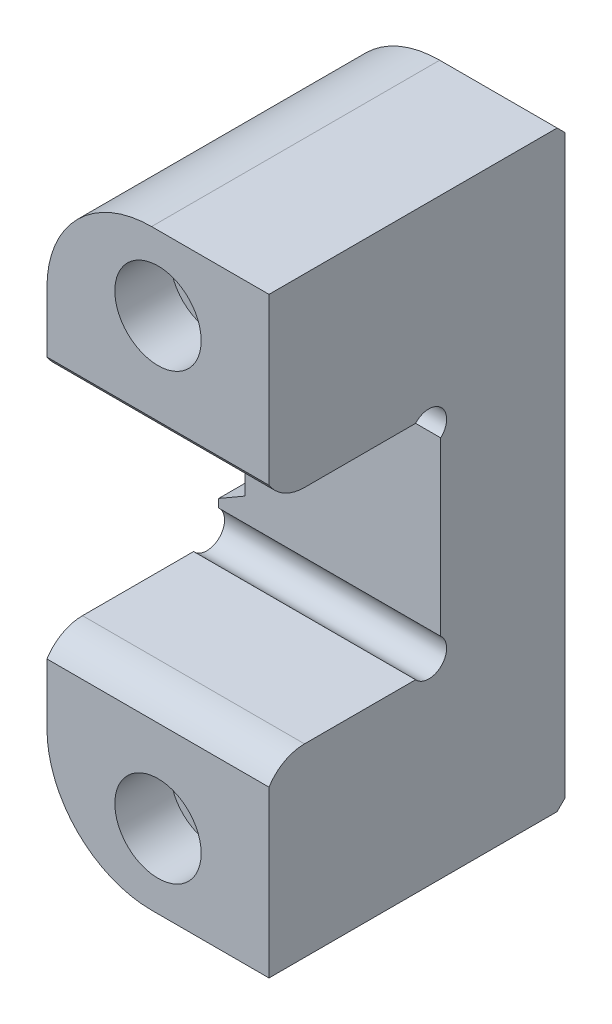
ISO-10303-21;
HEADER;
FILE_DESCRIPTION(('STEP AP214'),'2;1');
FILE_NAME('part.step','',(''),(''),'','','');
FILE_SCHEMA(('AUTOMOTIVE_DESIGN { 1 0 10303 214 1 1 1 1 }'));
ENDSEC;
DATA;
#1=APPLICATION_CONTEXT('core data for automotive mechanical design processes');
#2=APPLICATION_PROTOCOL_DEFINITION('international standard','automotive_design',2000,#1);
#3=PRODUCT_CONTEXT('',#1,'mechanical');
#4=PRODUCT('Part','Part','',(#3));
#5=PRODUCT_RELATED_PRODUCT_CATEGORY('part','',(#4));
#6=PRODUCT_DEFINITION_FORMATION('','',#4);
#7=PRODUCT_DEFINITION_CONTEXT('part definition',#1,'design');
#8=PRODUCT_DEFINITION('design','',#6,#7);
#9=PRODUCT_DEFINITION_SHAPE('','',#8);
#10=(LENGTH_UNIT() NAMED_UNIT(*) SI_UNIT(.MILLI.,.METRE.));
#11=(NAMED_UNIT(*) PLANE_ANGLE_UNIT() SI_UNIT($,.RADIAN.));
#12=(NAMED_UNIT(*) SI_UNIT($,.STERADIAN.) SOLID_ANGLE_UNIT());
#13=UNCERTAINTY_MEASURE_WITH_UNIT(LENGTH_MEASURE(1.E-05),#10,'distance_accuracy_value','');
#14=(GEOMETRIC_REPRESENTATION_CONTEXT(3) GLOBAL_UNCERTAINTY_ASSIGNED_CONTEXT((#13)) GLOBAL_UNIT_ASSIGNED_CONTEXT((#10,
#11,#12)) REPRESENTATION_CONTEXT('',''));
#15=CARTESIAN_POINT('',(0.,0.,0.));
#16=DIRECTION('',(0.,0.,1.));
#17=DIRECTION('',(1.,0.,0.));
#18=AXIS2_PLACEMENT_3D('',#15,#16,#17);
#19=CARTESIAN_POINT('',(14.2875,14.2875,-22.098));
#20=DIRECTION('',(0.,0.,-1.));
#21=DIRECTION('',(-1.,0.,0.));
#22=AXIS2_PLACEMENT_3D('',#19,#20,#21);
#23=PLANE('',#22);
#24=DIRECTION('',(-0.866025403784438,0.5,0.));
#25=VECTOR('',#24,1.);
#26=CARTESIAN_POINT('',(5.27996450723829,-1.31400912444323,-22.098));
#27=LINE('',#26,#25);
#28=CARTESIAN_POINT('',(-10.8853635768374,8.01904739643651,-22.098));
#29=VERTEX_POINT('',#28);
#30=CARTESIAN_POINT('',(-14.2875,9.98327177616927,-22.098));
#31=VERTEX_POINT('',#30);
#32=EDGE_CURVE('E340',#29,#31,#27,.T.);
#33=ORIENTED_EDGE('',*,*,#32,.F.);
#34=DIRECTION('',(0.,-1.,0.));
#35=VECTOR('',#34,1.);
#36=CARTESIAN_POINT('',(-10.8853635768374,-8.60845644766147,-22.098));
#37=LINE('',#36,#35);
#38=CARTESIAN_POINT('',(-10.8853635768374,-8.01904739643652,-22.098));
#39=VERTEX_POINT('',#38);
#40=EDGE_CURVE('E255',#29,#39,#37,.T.);
#41=ORIENTED_EDGE('',*,*,#40,.T.);
#42=DIRECTION('',(0.866025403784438,0.5,0.));
#43=VECTOR('',#42,1.);
#44=CARTESIAN_POINT('',(17.6533024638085,8.45775912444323,-22.098));
#45=LINE('',#44,#43);
#46=CARTESIAN_POINT('',(-14.2875,-9.98327177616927,-22.098));
#47=VERTEX_POINT('',#46);
#48=EDGE_CURVE('E338',#47,#39,#45,.T.);
#49=ORIENTED_EDGE('',*,*,#48,.F.);
#50=DIRECTION('',(0.,-1.,0.));
#51=VECTOR('',#50,1.);
#52=CARTESIAN_POINT('',(-14.2875,14.2875,-22.098));
#53=LINE('',#52,#51);
#54=CARTESIAN_POINT('',(-14.2875,-11.0596162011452,-22.098));
#55=VERTEX_POINT('',#54);
#56=EDGE_CURVE('E221',#47,#55,#53,.T.);
#57=ORIENTED_EDGE('',*,*,#56,.T.);
#58=DIRECTION('',(1.,0.,0.));
#59=VECTOR('',#58,1.);
#60=CARTESIAN_POINT('',(-14.2875,-11.0596162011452,-22.098));
#61=LINE('',#60,#59);
#62=CARTESIAN_POINT('',(14.2875,-11.0596162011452,-22.098));
#63=VERTEX_POINT('',#62);
#64=EDGE_CURVE('E194',#55,#63,#61,.T.);
#65=ORIENTED_EDGE('',*,*,#64,.T.);
#66=DIRECTION('',(0.,-1.,0.));
#67=VECTOR('',#66,1.);
#68=CARTESIAN_POINT('',(14.2875,14.2875,-22.098));
#69=LINE('',#68,#67);
#70=CARTESIAN_POINT('',(14.2875,11.0596162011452,-22.098));
#71=VERTEX_POINT('',#70);
#72=EDGE_CURVE('E348',#71,#63,#69,.T.);
#73=ORIENTED_EDGE('',*,*,#72,.F.);
#74=DIRECTION('',(1.,0.,0.));
#75=VECTOR('',#74,1.);
#76=CARTESIAN_POINT('',(-14.2875,11.0596162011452,-22.098));
#77=LINE('',#76,#75);
#78=CARTESIAN_POINT('',(-14.2875,11.0596162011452,-22.098));
#79=VERTEX_POINT('',#78);
#80=EDGE_CURVE('E416',#71,#79,#77,.F.);
#81=ORIENTED_EDGE('',*,*,#80,.T.);
#82=EDGE_CURVE('E215',#79,#31,#53,.T.);
#83=ORIENTED_EDGE('',*,*,#82,.T.);
#84=EDGE_LOOP('',(#33,#41,#49,#57,#65,#73,#81,#83));
#85=FACE_BOUND('',#84,.T.);
#86=ADVANCED_FACE('F32',(#85),#23,.F.);
#87=CARTESIAN_POINT('',(14.2875,38.1,-38.1));
#88=DIRECTION('',(0.,0.,1.));
#89=DIRECTION('',(1.,0.,0.));
#90=AXIS2_PLACEMENT_3D('',#87,#88,#89);
#91=PLANE('',#90);
#92=CARTESIAN_POINT('',(0.,28.575,-38.1));
#93=DIRECTION('',(0.,0.,1.));
#94=DIRECTION('',(1.,0.,0.));
#95=AXIS2_PLACEMENT_3D('',#92,#93,#94);
#96=CIRCLE('',#95,3.57123999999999);
#97=CARTESIAN_POINT('',(3.57123999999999,28.575,-38.1));
#98=VERTEX_POINT('',#97);
#99=EDGE_CURVE('E723',#98,#98,#96,.T.);
#100=ORIENTED_EDGE('',*,*,#99,.T.);
#101=EDGE_LOOP('',(#100));
#102=FACE_BOUND('',#101,.T.);
#103=CARTESIAN_POINT('',(0.,-28.575,-38.1));
#104=DIRECTION('',(0.,0.,1.));
#105=DIRECTION('',(1.,0.,0.));
#106=AXIS2_PLACEMENT_3D('',#103,#104,#105);
#107=CIRCLE('',#106,3.57123999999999);
#108=CARTESIAN_POINT('',(3.57123999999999,-28.575,-38.1));
#109=VERTEX_POINT('',#108);
#110=EDGE_CURVE('E709',#109,#109,#107,.T.);
#111=ORIENTED_EDGE('',*,*,#110,.T.);
#112=EDGE_LOOP('',(#111));
#113=FACE_BOUND('',#112,.T.);
#114=CARTESIAN_POINT('',(-0.8255,-24.638,-38.1));
#115=DIRECTION('',(0.,0.,1.));
#116=DIRECTION('',(1.,0.,0.));
#117=AXIS2_PLACEMENT_3D('',#114,#115,#116);
#118=CIRCLE('',#117,12.446);
#119=CARTESIAN_POINT('',(-0.8255,-37.084,-38.1));
#120=VERTEX_POINT('',#119);
#121=CARTESIAN_POINT('',(-13.2715,-24.638,-38.1));
#122=VERTEX_POINT('',#121);
#123=EDGE_CURVE('E271',#120,#122,#118,.F.);
#124=ORIENTED_EDGE('',*,*,#123,.T.);
#125=DIRECTION('',(0.,1.,0.));
#126=VECTOR('',#125,1.);
#127=CARTESIAN_POINT('',(-13.2715,-9.98327177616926,-38.1));
#128=LINE('',#127,#126);
#129=CARTESIAN_POINT('',(-13.2715,-9.3966839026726,-38.1));
#130=VERTEX_POINT('',#129);
#131=EDGE_CURVE('E273',#122,#130,#128,.T.);
#132=ORIENTED_EDGE('',*,*,#131,.T.);
#133=DIRECTION('',(0.866025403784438,0.5,0.));
#134=VECTOR('',#133,1.);
#135=CARTESIAN_POINT('',(-11.90625,-8.60845644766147,-38.1));
#136=LINE('',#135,#134);
#137=CARTESIAN_POINT('',(-11.90625,-8.60845644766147,-38.1));
#138=VERTEX_POINT('',#137);
#139=EDGE_CURVE('E324',#130,#138,#136,.T.);
#140=ORIENTED_EDGE('',*,*,#139,.T.);
#141=DIRECTION('',(0.,1.,0.));
#142=VECTOR('',#141,1.);
#143=CARTESIAN_POINT('',(-11.90625,8.60845644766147,-38.1));
#144=LINE('',#143,#142);
#145=CARTESIAN_POINT('',(-11.90625,8.60845644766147,-38.1));
#146=VERTEX_POINT('',#145);
#147=EDGE_CURVE('E323',#138,#146,#144,.T.);
#148=ORIENTED_EDGE('',*,*,#147,.T.);
#149=DIRECTION('',(-0.866025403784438,0.5,0.));
#150=VECTOR('',#149,1.);
#151=CARTESIAN_POINT('',(-11.90625,8.60845644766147,-38.1));
#152=LINE('',#151,#150);
#153=CARTESIAN_POINT('',(-13.2715,9.3966839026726,-38.1));
#154=VERTEX_POINT('',#153);
#155=EDGE_CURVE('E317',#146,#154,#152,.T.);
#156=ORIENTED_EDGE('',*,*,#155,.T.);
#157=DIRECTION('',(0.,1.,0.));
#158=VECTOR('',#157,1.);
#159=CARTESIAN_POINT('',(-13.2715,24.638,-38.1));
#160=LINE('',#159,#158);
#161=CARTESIAN_POINT('',(-13.2715,24.638,-38.1));
#162=VERTEX_POINT('',#161);
#163=EDGE_CURVE('E265',#154,#162,#160,.T.);
#164=ORIENTED_EDGE('',*,*,#163,.T.);
#165=CARTESIAN_POINT('',(-0.8255,24.638,-38.1));
#166=DIRECTION('',(0.,0.,1.));
#167=DIRECTION('',(1.,0.,0.));
#168=AXIS2_PLACEMENT_3D('',#165,#166,#167);
#169=CIRCLE('',#168,12.446);
#170=CARTESIAN_POINT('',(-0.8255,37.084,-38.1));
#171=VERTEX_POINT('',#170);
#172=EDGE_CURVE('E263',#162,#171,#169,.F.);
#173=ORIENTED_EDGE('',*,*,#172,.T.);
#174=DIRECTION('',(1.,0.,0.));
#175=VECTOR('',#174,1.);
#176=CARTESIAN_POINT('',(14.2875,37.084,-38.1));
#177=LINE('',#176,#175);
#178=CARTESIAN_POINT('',(14.2875,37.084,-38.1));
#179=VERTEX_POINT('',#178);
#180=EDGE_CURVE('E267',#171,#179,#177,.T.);
#181=ORIENTED_EDGE('',*,*,#180,.T.);
#182=DIRECTION('',(0.,1.,0.));
#183=VECTOR('',#182,1.);
#184=CARTESIAN_POINT('',(14.2875,38.1,-38.1));
#185=LINE('',#184,#183);
#186=CARTESIAN_POINT('',(14.2875,-37.084,-38.1));
#187=VERTEX_POINT('',#186);
#188=EDGE_CURVE('E357',#187,#179,#185,.T.);
#189=ORIENTED_EDGE('',*,*,#188,.F.);
#190=DIRECTION('',(-1.,0.,0.));
#191=VECTOR('',#190,1.);
#192=CARTESIAN_POINT('',(14.2875,-37.084,-38.1));
#193=LINE('',#192,#191);
#194=EDGE_CURVE('E269',#187,#120,#193,.T.);
#195=ORIENTED_EDGE('',*,*,#194,.T.);
#196=EDGE_LOOP('',(#124,#132,#140,#148,#156,#164,#173,#181,#189,#195));
#197=FACE_BOUND('',#196,.T.);
#198=ADVANCED_FACE('F321',(#102,#113,#197),#91,.F.);
#199=CARTESIAN_POINT('',(-14.2875,-14.2875,0.));
#200=DIRECTION('',(-1.,0.,0.));
#201=DIRECTION('',(0.,0.,1.));
#202=AXIS2_PLACEMENT_3D('',#199,#200,#201);
#203=PLANE('',#202);
#204=DIRECTION('',(0.,0.,1.));
#205=VECTOR('',#204,1.);
#206=CARTESIAN_POINT('',(-14.2875,24.638,-38.1));
#207=LINE('',#206,#205);
#208=CARTESIAN_POINT('',(-14.2875,24.638,0.));
#209=VERTEX_POINT('',#208);
#210=CARTESIAN_POINT('',(-14.2875,24.638,-37.084));
#211=VERTEX_POINT('',#210);
#212=EDGE_CURVE('E235',#209,#211,#207,.F.);
#213=ORIENTED_EDGE('',*,*,#212,.T.);
#214=DIRECTION('',(0.,-1.,0.));
#215=VECTOR('',#214,1.);
#216=CARTESIAN_POINT('',(-14.2875,9.98327177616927,-37.084));
#217=LINE('',#216,#215);
#218=CARTESIAN_POINT('',(-14.2875,9.98327177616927,-37.084));
#219=VERTEX_POINT('',#218);
#220=EDGE_CURVE('E49',#211,#219,#217,.T.);
#221=ORIENTED_EDGE('',*,*,#220,.T.);
#222=DIRECTION('',(0.,0.,1.));
#223=VECTOR('',#222,1.);
#224=CARTESIAN_POINT('',(-14.2875,9.98327177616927,0.));
#225=LINE('',#224,#223);
#226=EDGE_CURVE('E247',#219,#31,#225,.T.);
#227=ORIENTED_EDGE('',*,*,#226,.T.);
#228=ORIENTED_EDGE('',*,*,#82,.F.);
#229=CARTESIAN_POINT('',(-14.2875,12.7635,-20.574));
#230=DIRECTION('',(1.,0.,0.));
#231=DIRECTION('',(0.,0.,-1.));
#232=AXIS2_PLACEMENT_3D('',#229,#230,#231);
#233=CIRCLE('',#232,2.286);
#234=CARTESIAN_POINT('',(-14.2875,14.2875,-18.8701162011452));
#235=VERTEX_POINT('',#234);
#236=EDGE_CURVE('E423',#79,#235,#233,.T.);
#237=ORIENTED_EDGE('',*,*,#236,.T.);
#238=DIRECTION('',(0.,0.,-1.));
#239=VECTOR('',#238,1.);
#240=CARTESIAN_POINT('',(-14.2875,14.2875,0.));
#241=LINE('',#240,#239);
#242=CARTESIAN_POINT('',(-14.2875,14.2875,-4.57199999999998));
#243=VERTEX_POINT('',#242);
#244=EDGE_CURVE('E362',#243,#235,#241,.T.);
#245=ORIENTED_EDGE('',*,*,#244,.F.);
#246=CARTESIAN_POINT('',(-14.2875,19.6722999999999,-4.57199999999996));
#247=DIRECTION('',(-1.,0.,0.));
#248=DIRECTION('',(0.,0.,-1.));
#249=AXIS2_PLACEMENT_3D('',#246,#247,#248);
#250=CIRCLE('',#249,5.38479999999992);
#251=CARTESIAN_POINT('',(-14.2875,16.8275,0.));
#252=VERTEX_POINT('',#251);
#253=EDGE_CURVE('E415',#243,#252,#250,.T.);
#254=ORIENTED_EDGE('',*,*,#253,.T.);
#255=DIRECTION('',(0.,-1.,0.));
#256=VECTOR('',#255,1.);
#257=CARTESIAN_POINT('',(-14.2875,38.1,0.));
#258=LINE('',#257,#256);
#259=EDGE_CURVE('E342',#209,#252,#258,.T.);
#260=ORIENTED_EDGE('',*,*,#259,.F.);
#261=EDGE_LOOP('',(#213,#221,#227,#228,#237,#245,#254,#260));
#262=FACE_BOUND('',#261,.T.);
#263=ADVANCED_FACE('F459',(#262),#203,.T.);
#264=DIRECTION('',(0.,0.,-1.));
#265=VECTOR('',#264,1.);
#266=CARTESIAN_POINT('',(-14.2875,-9.98327177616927,0.));
#267=LINE('',#266,#265);
#268=CARTESIAN_POINT('',(-14.2875,-9.98327177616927,-37.084));
#269=VERTEX_POINT('',#268);
#270=EDGE_CURVE('E245',#47,#269,#267,.T.);
#271=ORIENTED_EDGE('',*,*,#270,.T.);
#272=DIRECTION('',(0.,-1.,0.));
#273=VECTOR('',#272,1.);
#274=CARTESIAN_POINT('',(-14.2875,-24.638,-37.084));
#275=LINE('',#274,#273);
#276=CARTESIAN_POINT('',(-14.2875,-24.638,-37.084));
#277=VERTEX_POINT('',#276);
#278=EDGE_CURVE('E278',#269,#277,#275,.T.);
#279=ORIENTED_EDGE('',*,*,#278,.T.);
#280=DIRECTION('',(0.,0.,-1.));
#281=VECTOR('',#280,1.);
#282=CARTESIAN_POINT('',(-14.2875,-24.638,0.));
#283=LINE('',#282,#281);
#284=CARTESIAN_POINT('',(-14.2875,-24.638,0.));
#285=VERTEX_POINT('',#284);
#286=EDGE_CURVE('E237',#277,#285,#283,.F.);
#287=ORIENTED_EDGE('',*,*,#286,.T.);
#288=DIRECTION('',(0.,-1.,0.));
#289=VECTOR('',#288,1.);
#290=CARTESIAN_POINT('',(-14.2875,-14.2875,0.));
#291=LINE('',#290,#289);
#292=CARTESIAN_POINT('',(-14.2875,-16.8275,0.));
#293=VERTEX_POINT('',#292);
#294=EDGE_CURVE('E214',#293,#285,#291,.T.);
#295=ORIENTED_EDGE('',*,*,#294,.F.);
#296=CARTESIAN_POINT('',(-14.2875,-19.6722999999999,-4.57199999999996));
#297=DIRECTION('',(-1.,0.,0.));
#298=DIRECTION('',(0.,0.,1.));
#299=AXIS2_PLACEMENT_3D('',#296,#297,#298);
#300=CIRCLE('',#299,5.38479999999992);
#301=CARTESIAN_POINT('',(-14.2875,-14.2875,-4.57199999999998));
#302=VERTEX_POINT('',#301);
#303=EDGE_CURVE('E213',#293,#302,#300,.T.);
#304=ORIENTED_EDGE('',*,*,#303,.T.);
#305=DIRECTION('',(0.,0.,1.));
#306=VECTOR('',#305,1.);
#307=CARTESIAN_POINT('',(-14.2875,-14.2875,-22.098));
#308=LINE('',#307,#306);
#309=CARTESIAN_POINT('',(-14.2875,-14.2875,-18.8701162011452));
#310=VERTEX_POINT('',#309);
#311=EDGE_CURVE('E205',#310,#302,#308,.T.);
#312=ORIENTED_EDGE('',*,*,#311,.F.);
#313=CARTESIAN_POINT('',(-14.2875,-12.7635,-20.574));
#314=DIRECTION('',(1.,0.,0.));
#315=DIRECTION('',(0.,0.,1.));
#316=AXIS2_PLACEMENT_3D('',#313,#314,#315);
#317=CIRCLE('',#316,2.286);
#318=EDGE_CURVE('E188',#310,#55,#317,.T.);
#319=ORIENTED_EDGE('',*,*,#318,.T.);
#320=ORIENTED_EDGE('',*,*,#56,.F.);
#321=EDGE_LOOP('',(#271,#279,#287,#295,#304,#312,#319,#320));
#322=FACE_BOUND('',#321,.T.);
#323=ADVANCED_FACE('F211',(#322),#203,.T.);
#324=CARTESIAN_POINT('',(14.2875,38.1,0.));
#325=DIRECTION('',(0.,0.,-1.));
#326=DIRECTION('',(0.,1.,0.));
#327=AXIS2_PLACEMENT_3D('',#324,#325,#326);
#328=PLANE('',#327);
#329=CARTESIAN_POINT('',(0.,28.575,0.));
#330=DIRECTION('',(0.,0.,1.));
#331=DIRECTION('',(1.,0.,0.));
#332=AXIS2_PLACEMENT_3D('',#329,#330,#331);
#333=CIRCLE('',#332,5.55625);
#334=CARTESIAN_POINT('',(5.55625,28.575,0.));
#335=VERTEX_POINT('',#334);
#336=EDGE_CURVE('E298',#335,#335,#333,.T.);
#337=ORIENTED_EDGE('',*,*,#336,.F.);
#338=EDGE_LOOP('',(#337));
#339=FACE_BOUND('',#338,.T.);
#340=ORIENTED_EDGE('',*,*,#259,.T.);
#341=DIRECTION('',(1.,0.,0.));
#342=VECTOR('',#341,1.);
#343=CARTESIAN_POINT('',(-14.2875,16.8275,0.));
#344=LINE('',#343,#342);
#345=CARTESIAN_POINT('',(14.2875,16.8275,0.));
#346=VERTEX_POINT('',#345);
#347=EDGE_CURVE('E410',#252,#346,#344,.T.);
#348=ORIENTED_EDGE('',*,*,#347,.T.);
#349=DIRECTION('',(0.,-1.,0.));
#350=VECTOR('',#349,1.);
#351=CARTESIAN_POINT('',(14.2875,38.1,0.));
#352=LINE('',#351,#350);
#353=CARTESIAN_POINT('',(14.2875,38.1,0.));
#354=VERTEX_POINT('',#353);
#355=EDGE_CURVE('E218',#354,#346,#352,.T.);
#356=ORIENTED_EDGE('',*,*,#355,.F.);
#357=DIRECTION('',(-1.,0.,0.));
#358=VECTOR('',#357,1.);
#359=CARTESIAN_POINT('',(14.2875,38.1,0.));
#360=LINE('',#359,#358);
#361=CARTESIAN_POINT('',(-0.8255,38.1,0.));
#362=VERTEX_POINT('',#361);
#363=EDGE_CURVE('E225',#354,#362,#360,.T.);
#364=ORIENTED_EDGE('',*,*,#363,.T.);
#365=CARTESIAN_POINT('',(-0.8255,24.638,0.));
#366=DIRECTION('',(0.,0.,-1.));
#367=DIRECTION('',(0.,1.,0.));
#368=AXIS2_PLACEMENT_3D('',#365,#366,#367);
#369=CIRCLE('',#368,13.462);
#370=EDGE_CURVE('E243',#362,#209,#369,.F.);
#371=ORIENTED_EDGE('',*,*,#370,.T.);
#372=EDGE_LOOP('',(#340,#348,#356,#364,#371));
#373=FACE_BOUND('',#372,.T.);
#374=ADVANCED_FACE('F409',(#339,#373),#328,.F.);
#375=CARTESIAN_POINT('',(14.2875,14.2875,0.));
#376=DIRECTION('',(0.,1.,0.));
#377=DIRECTION('',(0.,0.,1.));
#378=AXIS2_PLACEMENT_3D('',#375,#376,#377);
#379=PLANE('',#378);
#380=ORIENTED_EDGE('',*,*,#244,.T.);
#381=DIRECTION('',(1.,0.,0.));
#382=VECTOR('',#381,1.);
#383=CARTESIAN_POINT('',(-14.2875,14.2875,-18.8701162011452));
#384=LINE('',#383,#382);
#385=CARTESIAN_POINT('',(14.2875,14.2875,-18.8701162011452));
#386=VERTEX_POINT('',#385);
#387=EDGE_CURVE('E420',#235,#386,#384,.T.);
#388=ORIENTED_EDGE('',*,*,#387,.T.);
#389=DIRECTION('',(0.,0.,-1.));
#390=VECTOR('',#389,1.);
#391=CARTESIAN_POINT('',(14.2875,14.2875,0.));
#392=LINE('',#391,#390);
#393=CARTESIAN_POINT('',(14.2875,14.2875,-4.57199999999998));
#394=VERTEX_POINT('',#393);
#395=EDGE_CURVE('E345',#394,#386,#392,.T.);
#396=ORIENTED_EDGE('',*,*,#395,.F.);
#397=DIRECTION('',(1.,0.,0.));
#398=VECTOR('',#397,1.);
#399=CARTESIAN_POINT('',(-14.2875,14.2875,-4.57199999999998));
#400=LINE('',#399,#398);
#401=EDGE_CURVE('E419',#243,#394,#400,.T.);
#402=ORIENTED_EDGE('',*,*,#401,.F.);
#403=EDGE_LOOP('',(#380,#388,#396,#402));
#404=FACE_BOUND('',#403,.T.);
#405=ADVANCED_FACE('F418',(#404),#379,.F.);
#406=CARTESIAN_POINT('',(14.2875,-14.2875,-22.098));
#407=DIRECTION('',(0.,-1.,0.));
#408=DIRECTION('',(0.,0.,-1.));
#409=AXIS2_PLACEMENT_3D('',#406,#407,#408);
#410=PLANE('',#409);
#411=DIRECTION('',(0.,0.,1.));
#412=VECTOR('',#411,1.);
#413=CARTESIAN_POINT('',(14.2875,-14.2875,-22.098));
#414=LINE('',#413,#412);
#415=CARTESIAN_POINT('',(14.2875,-14.2875,-18.8701162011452));
#416=VERTEX_POINT('',#415);
#417=CARTESIAN_POINT('',(14.2875,-14.2875,-4.57199999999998));
#418=VERTEX_POINT('',#417);
#419=EDGE_CURVE('E207',#416,#418,#414,.T.);
#420=ORIENTED_EDGE('',*,*,#419,.F.);
#421=DIRECTION('',(1.,0.,0.));
#422=VECTOR('',#421,1.);
#423=CARTESIAN_POINT('',(-14.2875,-14.2875,-18.8701162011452));
#424=LINE('',#423,#422);
#425=EDGE_CURVE('E191',#416,#310,#424,.F.);
#426=ORIENTED_EDGE('',*,*,#425,.T.);
#427=ORIENTED_EDGE('',*,*,#311,.T.);
#428=DIRECTION('',(1.,0.,0.));
#429=VECTOR('',#428,1.);
#430=CARTESIAN_POINT('',(-14.2875,-14.2875,-4.57199999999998));
#431=LINE('',#430,#429);
#432=EDGE_CURVE('E328',#302,#418,#431,.T.);
#433=ORIENTED_EDGE('',*,*,#432,.T.);
#434=EDGE_LOOP('',(#420,#426,#427,#433));
#435=FACE_BOUND('',#434,.T.);
#436=ADVANCED_FACE('F203',(#435),#410,.F.);
#437=CARTESIAN_POINT('',(14.2875,-14.2875,0.));
#438=DIRECTION('',(0.,0.,-1.));
#439=DIRECTION('',(0.,1.,0.));
#440=AXIS2_PLACEMENT_3D('',#437,#438,#439);
#441=PLANE('',#440);
#442=CARTESIAN_POINT('',(0.,-28.575,0.));
#443=DIRECTION('',(0.,0.,1.));
#444=DIRECTION('',(1.,0.,0.));
#445=AXIS2_PLACEMENT_3D('',#442,#443,#444);
#446=CIRCLE('',#445,5.55625);
#447=CARTESIAN_POINT('',(5.55625,-28.575,0.));
#448=VERTEX_POINT('',#447);
#449=EDGE_CURVE('E720',#448,#448,#446,.T.);
#450=ORIENTED_EDGE('',*,*,#449,.F.);
#451=EDGE_LOOP('',(#450));
#452=FACE_BOUND('',#451,.T.);
#453=DIRECTION('',(0.,-1.,0.));
#454=VECTOR('',#453,1.);
#455=CARTESIAN_POINT('',(14.2875,-14.2875,0.));
#456=LINE('',#455,#454);
#457=CARTESIAN_POINT('',(14.2875,-16.8275,0.));
#458=VERTEX_POINT('',#457);
#459=CARTESIAN_POINT('',(14.2875,-38.1,0.));
#460=VERTEX_POINT('',#459);
#461=EDGE_CURVE('E352',#458,#460,#456,.T.);
#462=ORIENTED_EDGE('',*,*,#461,.F.);
#463=DIRECTION('',(1.,0.,0.));
#464=VECTOR('',#463,1.);
#465=CARTESIAN_POINT('',(-14.2875,-16.8275,0.));
#466=LINE('',#465,#464);
#467=EDGE_CURVE('E325',#293,#458,#466,.T.);
#468=ORIENTED_EDGE('',*,*,#467,.F.);
#469=ORIENTED_EDGE('',*,*,#294,.T.);
#470=CARTESIAN_POINT('',(-0.8255,-24.638,0.));
#471=DIRECTION('',(0.,0.,-1.));
#472=DIRECTION('',(0.,1.,0.));
#473=AXIS2_PLACEMENT_3D('',#470,#471,#472);
#474=CIRCLE('',#473,13.462);
#475=CARTESIAN_POINT('',(-0.8255,-38.1,0.));
#476=VERTEX_POINT('',#475);
#477=EDGE_CURVE('E239',#285,#476,#474,.F.);
#478=ORIENTED_EDGE('',*,*,#477,.T.);
#479=DIRECTION('',(-1.,0.,0.));
#480=VECTOR('',#479,1.);
#481=CARTESIAN_POINT('',(14.2875,-38.1,0.));
#482=LINE('',#481,#480);
#483=EDGE_CURVE('E228',#460,#476,#482,.T.);
#484=ORIENTED_EDGE('',*,*,#483,.F.);
#485=EDGE_LOOP('',(#462,#468,#469,#478,#484));
#486=FACE_BOUND('',#485,.T.);
#487=ADVANCED_FACE('F443',(#452,#486),#441,.F.);
#488=CARTESIAN_POINT('',(14.2875,-38.1,0.));
#489=DIRECTION('',(0.,1.,0.));
#490=DIRECTION('',(0.,0.,1.));
#491=AXIS2_PLACEMENT_3D('',#488,#489,#490);
#492=PLANE('',#491);
#493=DIRECTION('',(0.,0.,-1.));
#494=VECTOR('',#493,1.);
#495=CARTESIAN_POINT('',(-0.8255,-38.1,-38.1));
#496=LINE('',#495,#494);
#497=CARTESIAN_POINT('',(-0.8255,-38.1,-37.084));
#498=VERTEX_POINT('',#497);
#499=EDGE_CURVE('E232',#476,#498,#496,.T.);
#500=ORIENTED_EDGE('',*,*,#499,.T.);
#501=DIRECTION('',(1.,0.,0.));
#502=VECTOR('',#501,1.);
#503=CARTESIAN_POINT('',(14.2875,-38.1,-37.084));
#504=LINE('',#503,#502);
#505=CARTESIAN_POINT('',(14.2875,-38.1,-37.084));
#506=VERTEX_POINT('',#505);
#507=EDGE_CURVE('E282',#498,#506,#504,.T.);
#508=ORIENTED_EDGE('',*,*,#507,.T.);
#509=DIRECTION('',(0.,0.,-1.));
#510=VECTOR('',#509,1.);
#511=CARTESIAN_POINT('',(14.2875,-38.1,0.));
#512=LINE('',#511,#510);
#513=EDGE_CURVE('E354',#460,#506,#512,.T.);
#514=ORIENTED_EDGE('',*,*,#513,.F.);
#515=ORIENTED_EDGE('',*,*,#483,.T.);
#516=EDGE_LOOP('',(#500,#508,#514,#515));
#517=FACE_BOUND('',#516,.T.);
#518=ADVANCED_FACE('F389',(#517),#492,.F.);
#519=CARTESIAN_POINT('',(14.2875,38.1,0.));
#520=DIRECTION('',(0.,-1.,0.));
#521=DIRECTION('',(0.,0.,-1.));
#522=AXIS2_PLACEMENT_3D('',#519,#520,#521);
#523=PLANE('',#522);
#524=DIRECTION('',(0.,0.,1.));
#525=VECTOR('',#524,1.);
#526=CARTESIAN_POINT('',(14.2875,38.1,0.));
#527=LINE('',#526,#525);
#528=CARTESIAN_POINT('',(14.2875,38.1,-37.084));
#529=VERTEX_POINT('',#528);
#530=EDGE_CURVE('E229',#529,#354,#527,.T.);
#531=ORIENTED_EDGE('',*,*,#530,.F.);
#532=DIRECTION('',(-1.,0.,0.));
#533=VECTOR('',#532,1.);
#534=CARTESIAN_POINT('',(14.2875,38.1,-37.084));
#535=LINE('',#534,#533);
#536=CARTESIAN_POINT('',(-0.8255,38.1,-37.084));
#537=VERTEX_POINT('',#536);
#538=EDGE_CURVE('E288',#529,#537,#535,.T.);
#539=ORIENTED_EDGE('',*,*,#538,.T.);
#540=DIRECTION('',(0.,0.,1.));
#541=VECTOR('',#540,1.);
#542=CARTESIAN_POINT('',(-0.8255,38.1,0.));
#543=LINE('',#542,#541);
#544=EDGE_CURVE('E241',#537,#362,#543,.T.);
#545=ORIENTED_EDGE('',*,*,#544,.T.);
#546=ORIENTED_EDGE('',*,*,#363,.F.);
#547=EDGE_LOOP('',(#531,#539,#545,#546));
#548=FACE_BOUND('',#547,.T.);
#549=ADVANCED_FACE('F404',(#548),#523,.F.);
#550=CARTESIAN_POINT('',(14.2875,-14.2875,0.));
#551=DIRECTION('',(-1.,0.,0.));
#552=DIRECTION('',(0.,0.,1.));
#553=AXIS2_PLACEMENT_3D('',#550,#551,#552);
#554=PLANE('',#553);
#555=ORIENTED_EDGE('',*,*,#513,.T.);
#556=DIRECTION('',(0.,-0.707106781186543,0.707106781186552));
#557=VECTOR('',#556,1.);
#558=CARTESIAN_POINT('',(14.2875,-37.084,-38.1));
#559=LINE('',#558,#557);
#560=EDGE_CURVE('E286',#506,#187,#559,.F.);
#561=ORIENTED_EDGE('',*,*,#560,.T.);
#562=ORIENTED_EDGE('',*,*,#188,.T.);
#563=DIRECTION('',(0.,-0.70710678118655,-0.707106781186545));
#564=VECTOR('',#563,1.);
#565=CARTESIAN_POINT('',(14.2875,38.1,-37.084));
#566=LINE('',#565,#564);
#567=EDGE_CURVE('E284',#179,#529,#566,.F.);
#568=ORIENTED_EDGE('',*,*,#567,.T.);
#569=ORIENTED_EDGE('',*,*,#530,.T.);
#570=ORIENTED_EDGE('',*,*,#355,.T.);
#571=CARTESIAN_POINT('',(14.2875,19.6722999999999,-4.57199999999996));
#572=DIRECTION('',(-1.,0.,0.));
#573=DIRECTION('',(0.,0.,-1.));
#574=AXIS2_PLACEMENT_3D('',#571,#572,#573);
#575=CIRCLE('',#574,5.38479999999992);
#576=EDGE_CURVE('E412',#394,#346,#575,.T.);
#577=ORIENTED_EDGE('',*,*,#576,.F.);
#578=ORIENTED_EDGE('',*,*,#395,.T.);
#579=CARTESIAN_POINT('',(14.2875,12.7635,-20.574));
#580=DIRECTION('',(-1.,0.,0.));
#581=DIRECTION('',(0.,0.,1.));
#582=AXIS2_PLACEMENT_3D('',#579,#580,#581);
#583=CIRCLE('',#582,2.286);
#584=EDGE_CURVE('E249',#386,#71,#583,.T.);
#585=ORIENTED_EDGE('',*,*,#584,.T.);
#586=ORIENTED_EDGE('',*,*,#72,.T.);
#587=CARTESIAN_POINT('',(14.2875,-12.7635,-20.574));
#588=DIRECTION('',(1.,0.,0.));
#589=DIRECTION('',(0.,0.,1.));
#590=AXIS2_PLACEMENT_3D('',#587,#588,#589);
#591=CIRCLE('',#590,2.286);
#592=EDGE_CURVE('E199',#416,#63,#591,.T.);
#593=ORIENTED_EDGE('',*,*,#592,.F.);
#594=ORIENTED_EDGE('',*,*,#419,.T.);
#595=CARTESIAN_POINT('',(14.2875,-19.6722999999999,-4.57199999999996));
#596=DIRECTION('',(-1.,0.,0.));
#597=DIRECTION('',(0.,0.,1.));
#598=AXIS2_PLACEMENT_3D('',#595,#596,#597);
#599=CIRCLE('',#598,5.38479999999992);
#600=EDGE_CURVE('E433',#458,#418,#599,.T.);
#601=ORIENTED_EDGE('',*,*,#600,.F.);
#602=ORIENTED_EDGE('',*,*,#461,.T.);
#603=EDGE_LOOP('',(#555,#561,#562,#568,#569,#570,#577,#578,#585,#586,#593,#594,#601,#602));
#604=FACE_BOUND('',#603,.T.);
#605=ADVANCED_FACE('F398',(#604),#554,.F.);
#606=CARTESIAN_POINT('',(-0.8255,-24.638,0.));
#607=DIRECTION('',(0.,0.,1.));
#608=DIRECTION('',(1.,0.,0.));
#609=AXIS2_PLACEMENT_3D('',#606,#607,#608);
#610=CYLINDRICAL_SURFACE('',#609,13.462);
#611=ORIENTED_EDGE('',*,*,#286,.F.);
#612=CARTESIAN_POINT('',(-0.8255,-24.638,-37.084));
#613=DIRECTION('',(0.,0.,1.));
#614=DIRECTION('',(1.,0.,0.));
#615=AXIS2_PLACEMENT_3D('',#612,#613,#614);
#616=CIRCLE('',#615,13.462);
#617=EDGE_CURVE('E280',#277,#498,#616,.T.);
#618=ORIENTED_EDGE('',*,*,#617,.T.);
#619=ORIENTED_EDGE('',*,*,#499,.F.);
#620=ORIENTED_EDGE('',*,*,#477,.F.);
#621=EDGE_LOOP('',(#611,#618,#619,#620));
#622=FACE_BOUND('',#621,.T.);
#623=ADVANCED_FACE('F385',(#622),#610,.T.);
#624=CARTESIAN_POINT('',(-0.8255,24.638,0.));
#625=DIRECTION('',(0.,0.,-1.));
#626=DIRECTION('',(-1.,0.,0.));
#627=AXIS2_PLACEMENT_3D('',#624,#625,#626);
#628=CYLINDRICAL_SURFACE('',#627,13.462);
#629=ORIENTED_EDGE('',*,*,#544,.F.);
#630=CARTESIAN_POINT('',(-0.8255,24.638,-37.084));
#631=DIRECTION('',(0.,0.,1.));
#632=DIRECTION('',(1.,0.,0.));
#633=AXIS2_PLACEMENT_3D('',#630,#631,#632);
#634=CIRCLE('',#633,13.462);
#635=EDGE_CURVE('E11',#537,#211,#634,.T.);
#636=ORIENTED_EDGE('',*,*,#635,.T.);
#637=ORIENTED_EDGE('',*,*,#212,.F.);
#638=ORIENTED_EDGE('',*,*,#370,.F.);
#639=EDGE_LOOP('',(#629,#636,#637,#638));
#640=FACE_BOUND('',#639,.T.);
#641=ADVANCED_FACE('F470',(#640),#628,.T.);
#642=CARTESIAN_POINT('',(-11.90625,8.60845644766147,0.));
#643=DIRECTION('',(-1.,0.,0.));
#644=DIRECTION('',(0.,0.,1.));
#645=AXIS2_PLACEMENT_3D('',#642,#643,#644);
#646=PLANE('',#645);
#647=DIRECTION('',(0.,0.,-1.));
#648=VECTOR('',#647,1.);
#649=CARTESIAN_POINT('',(-11.90625,-8.60845644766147,0.));
#650=LINE('',#649,#648);
#651=CARTESIAN_POINT('',(-11.90625,-8.60845644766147,-25.908));
#652=VERTEX_POINT('',#651);
#653=EDGE_CURVE('E335',#652,#138,#650,.T.);
#654=ORIENTED_EDGE('',*,*,#653,.F.);
#655=DIRECTION('',(0.,1.,0.));
#656=VECTOR('',#655,1.);
#657=CARTESIAN_POINT('',(-11.90625,8.60845644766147,-25.9080000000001));
#658=LINE('',#657,#656);
#659=CARTESIAN_POINT('',(-11.90625,8.60845644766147,-25.908));
#660=VERTEX_POINT('',#659);
#661=EDGE_CURVE('E252',#652,#660,#658,.T.);
#662=ORIENTED_EDGE('',*,*,#661,.T.);
#663=DIRECTION('',(0.,0.,-1.));
#664=VECTOR('',#663,1.);
#665=CARTESIAN_POINT('',(-11.90625,8.60845644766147,0.));
#666=LINE('',#665,#664);
#667=EDGE_CURVE('E333',#660,#146,#666,.T.);
#668=ORIENTED_EDGE('',*,*,#667,.T.);
#669=ORIENTED_EDGE('',*,*,#147,.F.);
#670=EDGE_LOOP('',(#654,#662,#668,#669));
#671=FACE_BOUND('',#670,.T.);
#672=ADVANCED_FACE('F473',(#671),#646,.T.);
#673=CARTESIAN_POINT('',(-11.90625,8.60845644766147,0.));
#674=DIRECTION('',(-0.5,-0.866025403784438,0.));
#675=DIRECTION('',(0.866025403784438,-0.5,0.));
#676=AXIS2_PLACEMENT_3D('',#673,#674,#675);
#677=PLANE('',#676);
#678=ORIENTED_EDGE('',*,*,#226,.F.);
#679=DIRECTION('',(0.65465367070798,-0.377964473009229,-0.654653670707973));
#680=VECTOR('',#679,1.);
#681=CARTESIAN_POINT('',(-28.8199285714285,18.3735733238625,-22.5515714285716));
#682=LINE('',#681,#680);
#683=EDGE_CURVE('E41',#219,#154,#682,.T.);
#684=ORIENTED_EDGE('',*,*,#683,.T.);
#685=ORIENTED_EDGE('',*,*,#155,.F.);
#686=ORIENTED_EDGE('',*,*,#667,.F.);
#687=DIRECTION('',(0.255976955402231,-0.147788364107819,0.955319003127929));
#688=VECTOR('',#687,1.);
#689=CARTESIAN_POINT('',(-11.90625,8.60845644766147,-25.9080000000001));
#690=LINE('',#689,#688);
#691=EDGE_CURVE('E258',#660,#29,#690,.T.);
#692=ORIENTED_EDGE('',*,*,#691,.T.);
#693=ORIENTED_EDGE('',*,*,#32,.T.);
#694=EDGE_LOOP('',(#678,#684,#685,#686,#692,#693));
#695=FACE_BOUND('',#694,.T.);
#696=ADVANCED_FACE('F315',(#695),#677,.T.);
#697=CARTESIAN_POINT('',(-11.90625,-8.60845644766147,0.));
#698=DIRECTION('',(-0.5,0.866025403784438,0.));
#699=DIRECTION('',(-0.866025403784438,-0.5,0.));
#700=AXIS2_PLACEMENT_3D('',#697,#698,#699);
#701=PLANE('',#700);
#702=ORIENTED_EDGE('',*,*,#139,.F.);
#703=DIRECTION('',(-0.654653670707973,-0.377964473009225,0.654653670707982));
#704=VECTOR('',#703,1.);
#705=CARTESIAN_POINT('',(-28.8199285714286,-18.3735733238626,-22.5515714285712));
#706=LINE('',#705,#704);
#707=EDGE_CURVE('E276',#130,#269,#706,.T.);
#708=ORIENTED_EDGE('',*,*,#707,.T.);
#709=ORIENTED_EDGE('',*,*,#270,.F.);
#710=ORIENTED_EDGE('',*,*,#48,.T.);
#711=DIRECTION('',(-0.255976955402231,-0.147788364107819,-0.955319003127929));
#712=VECTOR('',#711,1.);
#713=CARTESIAN_POINT('',(-11.2549270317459,-8.23241495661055,-23.477229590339));
#714=LINE('',#713,#712);
#715=EDGE_CURVE('E261',#39,#652,#714,.T.);
#716=ORIENTED_EDGE('',*,*,#715,.T.);
#717=ORIENTED_EDGE('',*,*,#653,.T.);
#718=EDGE_LOOP('',(#702,#708,#709,#710,#716,#717));
#719=FACE_BOUND('',#718,.T.);
#720=ADVANCED_FACE('F587',(#719),#701,.T.);
#721=CARTESIAN_POINT('',(-14.2875,-19.6722999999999,-4.57199999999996));
#722=DIRECTION('',(1.,0.,0.));
#723=DIRECTION('',(0.,0.,-1.));
#724=AXIS2_PLACEMENT_3D('',#721,#722,#723);
#725=CYLINDRICAL_SURFACE('',#724,5.38479999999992);
#726=ORIENTED_EDGE('',*,*,#600,.T.);
#727=ORIENTED_EDGE('',*,*,#432,.F.);
#728=ORIENTED_EDGE('',*,*,#303,.F.);
#729=ORIENTED_EDGE('',*,*,#467,.T.);
#730=EDGE_LOOP('',(#726,#727,#728,#729));
#731=FACE_BOUND('',#730,.T.);
#732=ADVANCED_FACE('F439',(#731),#725,.T.);
#733=CARTESIAN_POINT('',(-14.2875,19.6722999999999,-4.57199999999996));
#734=DIRECTION('',(1.,0.,0.));
#735=DIRECTION('',(0.,0.,-1.));
#736=AXIS2_PLACEMENT_3D('',#733,#734,#735);
#737=CYLINDRICAL_SURFACE('',#736,5.38479999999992);
#738=ORIENTED_EDGE('',*,*,#576,.T.);
#739=ORIENTED_EDGE('',*,*,#347,.F.);
#740=ORIENTED_EDGE('',*,*,#253,.F.);
#741=ORIENTED_EDGE('',*,*,#401,.T.);
#742=EDGE_LOOP('',(#738,#739,#740,#741));
#743=FACE_BOUND('',#742,.T.);
#744=ADVANCED_FACE('F572',(#743),#737,.T.);
#745=CARTESIAN_POINT('',(-14.2875,12.7635,-20.574));
#746=DIRECTION('',(1.,0.,0.));
#747=DIRECTION('',(0.,0.,-1.));
#748=AXIS2_PLACEMENT_3D('',#745,#746,#747);
#749=CYLINDRICAL_SURFACE('',#748,2.286);
#750=ORIENTED_EDGE('',*,*,#584,.F.);
#751=ORIENTED_EDGE('',*,*,#387,.F.);
#752=ORIENTED_EDGE('',*,*,#236,.F.);
#753=ORIENTED_EDGE('',*,*,#80,.F.);
#754=EDGE_LOOP('',(#750,#751,#752,#753));
#755=FACE_BOUND('',#754,.T.);
#756=ADVANCED_FACE('F564',(#755),#749,.F.);
#757=CARTESIAN_POINT('',(-14.2875,-12.7635,-20.574));
#758=DIRECTION('',(1.,0.,0.));
#759=DIRECTION('',(0.,0.,-1.));
#760=AXIS2_PLACEMENT_3D('',#757,#758,#759);
#761=CYLINDRICAL_SURFACE('',#760,2.286);
#762=ORIENTED_EDGE('',*,*,#318,.F.);
#763=ORIENTED_EDGE('',*,*,#425,.F.);
#764=ORIENTED_EDGE('',*,*,#592,.T.);
#765=ORIENTED_EDGE('',*,*,#64,.F.);
#766=EDGE_LOOP('',(#762,#763,#764,#765));
#767=FACE_BOUND('',#766,.T.);
#768=ADVANCED_FACE('F190',(#767),#761,.F.);
#769=CARTESIAN_POINT('',(0.,-28.575,0.));
#770=DIRECTION('',(0.,0.,1.));
#771=DIRECTION('',(1.,0.,0.));
#772=AXIS2_PLACEMENT_3D('',#769,#770,#771);
#773=CYLINDRICAL_SURFACE('',#772,3.57123999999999);
#774=ORIENTED_EDGE('',*,*,#110,.F.);
#775=EDGE_LOOP('',(#774));
#776=FACE_BOUND('',#775,.T.);
#777=CARTESIAN_POINT('',(0.,-28.575,-7.14375));
#778=DIRECTION('',(0.,0.,1.));
#779=DIRECTION('',(1.,0.,0.));
#780=AXIS2_PLACEMENT_3D('',#777,#778,#779);
#781=CIRCLE('',#780,3.57124);
#782=CARTESIAN_POINT('',(3.57124,-28.575,-7.14375));
#783=VERTEX_POINT('',#782);
#784=EDGE_CURVE('E712',#783,#783,#781,.T.);
#785=ORIENTED_EDGE('',*,*,#784,.T.);
#786=EDGE_LOOP('',(#785));
#787=FACE_BOUND('',#786,.T.);
#788=ADVANCED_FACE('F549',(#776,#787),#773,.F.);
#789=CARTESIAN_POINT('',(3.57124,-28.575,-7.14375));
#790=DIRECTION('',(0.,0.,-1.));
#791=DIRECTION('',(-1.,0.,0.));
#792=AXIS2_PLACEMENT_3D('',#789,#790,#791);
#793=PLANE('',#792);
#794=ORIENTED_EDGE('',*,*,#784,.F.);
#795=EDGE_LOOP('',(#794));
#796=FACE_BOUND('',#795,.T.);
#797=CARTESIAN_POINT('',(0.,-28.575,-7.14375));
#798=DIRECTION('',(0.,0.,1.));
#799=DIRECTION('',(1.,0.,0.));
#800=AXIS2_PLACEMENT_3D('',#797,#798,#799);
#801=CIRCLE('',#800,5.55625);
#802=CARTESIAN_POINT('',(5.55625,-28.575,-7.14375));
#803=VERTEX_POINT('',#802);
#804=EDGE_CURVE('E717',#803,#803,#801,.T.);
#805=ORIENTED_EDGE('',*,*,#804,.T.);
#806=EDGE_LOOP('',(#805));
#807=FACE_BOUND('',#806,.T.);
#808=ADVANCED_FACE('F541',(#796,#807),#793,.F.);
#809=CARTESIAN_POINT('',(0.,-28.575,0.));
#810=DIRECTION('',(0.,0.,1.));
#811=DIRECTION('',(1.,0.,0.));
#812=AXIS2_PLACEMENT_3D('',#809,#810,#811);
#813=CYLINDRICAL_SURFACE('',#812,5.55625);
#814=ORIENTED_EDGE('',*,*,#804,.F.);
#815=EDGE_LOOP('',(#814));
#816=FACE_BOUND('',#815,.T.);
#817=ORIENTED_EDGE('',*,*,#449,.T.);
#818=EDGE_LOOP('',(#817));
#819=FACE_BOUND('',#818,.T.);
#820=ADVANCED_FACE('F533',(#816,#819),#813,.F.);
#821=CARTESIAN_POINT('',(0.,28.575,0.));
#822=DIRECTION('',(0.,0.,1.));
#823=DIRECTION('',(1.,0.,0.));
#824=AXIS2_PLACEMENT_3D('',#821,#822,#823);
#825=CYLINDRICAL_SURFACE('',#824,3.57123999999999);
#826=ORIENTED_EDGE('',*,*,#99,.F.);
#827=EDGE_LOOP('',(#826));
#828=FACE_BOUND('',#827,.T.);
#829=CARTESIAN_POINT('',(0.,28.575,-7.14375));
#830=DIRECTION('',(0.,0.,1.));
#831=DIRECTION('',(1.,0.,0.));
#832=AXIS2_PLACEMENT_3D('',#829,#830,#831);
#833=CIRCLE('',#832,3.57124);
#834=CARTESIAN_POINT('',(3.57124,28.575,-7.14375));
#835=VERTEX_POINT('',#834);
#836=EDGE_CURVE('E726',#835,#835,#833,.T.);
#837=ORIENTED_EDGE('',*,*,#836,.T.);
#838=EDGE_LOOP('',(#837));
#839=FACE_BOUND('',#838,.T.);
#840=ADVANCED_FACE('F525',(#828,#839),#825,.F.);
#841=CARTESIAN_POINT('',(3.57124,28.575,-7.14375));
#842=DIRECTION('',(0.,0.,-1.));
#843=DIRECTION('',(-1.,0.,0.));
#844=AXIS2_PLACEMENT_3D('',#841,#842,#843);
#845=PLANE('',#844);
#846=ORIENTED_EDGE('',*,*,#836,.F.);
#847=EDGE_LOOP('',(#846));
#848=FACE_BOUND('',#847,.T.);
#849=CARTESIAN_POINT('',(0.,28.575,-7.14375));
#850=DIRECTION('',(0.,0.,1.));
#851=DIRECTION('',(1.,0.,0.));
#852=AXIS2_PLACEMENT_3D('',#849,#850,#851);
#853=CIRCLE('',#852,5.55625);
#854=CARTESIAN_POINT('',(5.55625,28.575,-7.14375));
#855=VERTEX_POINT('',#854);
#856=EDGE_CURVE('E729',#855,#855,#853,.T.);
#857=ORIENTED_EDGE('',*,*,#856,.T.);
#858=EDGE_LOOP('',(#857));
#859=FACE_BOUND('',#858,.T.);
#860=ADVANCED_FACE('F517',(#848,#859),#845,.F.);
#861=CARTESIAN_POINT('',(0.,28.575,0.));
#862=DIRECTION('',(0.,0.,1.));
#863=DIRECTION('',(1.,0.,0.));
#864=AXIS2_PLACEMENT_3D('',#861,#862,#863);
#865=CYLINDRICAL_SURFACE('',#864,5.55625);
#866=ORIENTED_EDGE('',*,*,#856,.F.);
#867=EDGE_LOOP('',(#866));
#868=FACE_BOUND('',#867,.T.);
#869=ORIENTED_EDGE('',*,*,#336,.T.);
#870=EDGE_LOOP('',(#869));
#871=FACE_BOUND('',#870,.T.);
#872=ADVANCED_FACE('F477',(#868,#871),#865,.F.);
#873=CARTESIAN_POINT('',(-11.90625,8.60845644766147,-25.9080000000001));
#874=DIRECTION('',(-0.965925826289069,0.,0.258819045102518));
#875=DIRECTION('',(0.258819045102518,0.,0.965925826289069));
#876=AXIS2_PLACEMENT_3D('',#873,#874,#875);
#877=PLANE('',#876);
#878=ORIENTED_EDGE('',*,*,#715,.F.);
#879=ORIENTED_EDGE('',*,*,#40,.F.);
#880=ORIENTED_EDGE('',*,*,#691,.F.);
#881=ORIENTED_EDGE('',*,*,#661,.F.);
#882=EDGE_LOOP('',(#878,#879,#880,#881));
#883=FACE_BOUND('',#882,.T.);
#884=ADVANCED_FACE('F474',(#883),#877,.T.);
#885=CARTESIAN_POINT('',(14.2875,-37.084,-38.1));
#886=DIRECTION('',(0.,0.707106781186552,0.707106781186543));
#887=DIRECTION('',(0.,-0.707106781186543,0.707106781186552));
#888=AXIS2_PLACEMENT_3D('',#885,#886,#887);
#889=PLANE('',#888);
#890=ORIENTED_EDGE('',*,*,#560,.F.);
#891=ORIENTED_EDGE('',*,*,#507,.F.);
#892=DIRECTION('',(0.,-0.707106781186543,0.707106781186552));
#893=VECTOR('',#892,1.);
#894=CARTESIAN_POINT('',(-0.8255,-37.084,-38.1));
#895=LINE('',#894,#893);
#896=EDGE_CURVE('E296',#120,#498,#895,.T.);
#897=ORIENTED_EDGE('',*,*,#896,.F.);
#898=ORIENTED_EDGE('',*,*,#194,.F.);
#899=EDGE_LOOP('',(#890,#891,#897,#898));
#900=FACE_BOUND('',#899,.T.);
#901=ADVANCED_FACE('F394',(#900),#889,.F.);
#902=CARTESIAN_POINT('',(-0.8255,-24.638,-38.1));
#903=DIRECTION('',(0.,0.,1.));
#904=DIRECTION('',(1.,0.,0.));
#905=AXIS2_PLACEMENT_3D('',#902,#903,#904);
#906=CONICAL_SURFACE('',#905,12.446,0.785398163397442);
#907=ORIENTED_EDGE('',*,*,#896,.T.);
#908=ORIENTED_EDGE('',*,*,#617,.F.);
#909=DIRECTION('',(-0.707106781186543,0.,0.707106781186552));
#910=VECTOR('',#909,1.);
#911=CARTESIAN_POINT('',(-13.2715,-24.638,-38.1));
#912=LINE('',#911,#910);
#913=EDGE_CURVE('E293',#122,#277,#912,.T.);
#914=ORIENTED_EDGE('',*,*,#913,.F.);
#915=ORIENTED_EDGE('',*,*,#123,.F.);
#916=EDGE_LOOP('',(#907,#908,#914,#915));
#917=FACE_BOUND('',#916,.T.);
#918=ADVANCED_FACE('F381',(#917),#906,.T.);
#919=CARTESIAN_POINT('',(-13.2715,38.1,-38.1));
#920=DIRECTION('',(-0.707106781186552,0.,-0.707106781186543));
#921=DIRECTION('',(-0.707106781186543,0.,0.707106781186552));
#922=AXIS2_PLACEMENT_3D('',#919,#920,#921);
#923=PLANE('',#922);
#924=ORIENTED_EDGE('',*,*,#913,.T.);
#925=ORIENTED_EDGE('',*,*,#278,.F.);
#926=ORIENTED_EDGE('',*,*,#707,.F.);
#927=ORIENTED_EDGE('',*,*,#131,.F.);
#928=EDGE_LOOP('',(#924,#925,#926,#927));
#929=FACE_BOUND('',#928,.T.);
#930=ADVANCED_FACE('F375',(#929),#923,.T.);
#931=CARTESIAN_POINT('',(-13.2715,38.1,-38.1));
#932=DIRECTION('',(-0.707106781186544,0.,-0.707106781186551));
#933=DIRECTION('',(-0.707106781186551,0.,0.707106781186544));
#934=AXIS2_PLACEMENT_3D('',#931,#932,#933);
#935=PLANE('',#934);
#936=ORIENTED_EDGE('',*,*,#683,.F.);
#937=ORIENTED_EDGE('',*,*,#220,.F.);
#938=DIRECTION('',(-0.707106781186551,0.,0.707106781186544));
#939=VECTOR('',#938,1.);
#940=CARTESIAN_POINT('',(-13.2715,24.638,-38.1));
#941=LINE('',#940,#939);
#942=EDGE_CURVE('E36',#162,#211,#941,.T.);
#943=ORIENTED_EDGE('',*,*,#942,.F.);
#944=ORIENTED_EDGE('',*,*,#163,.F.);
#945=EDGE_LOOP('',(#936,#937,#943,#944));
#946=FACE_BOUND('',#945,.T.);
#947=ADVANCED_FACE('F34',(#946),#935,.T.);
#948=CARTESIAN_POINT('',(-0.8255,24.638,-38.1));
#949=DIRECTION('',(0.,0.,1.));
#950=DIRECTION('',(1.,0.,0.));
#951=AXIS2_PLACEMENT_3D('',#948,#949,#950);
#952=CONICAL_SURFACE('',#951,12.446,0.785398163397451);
#953=ORIENTED_EDGE('',*,*,#942,.T.);
#954=ORIENTED_EDGE('',*,*,#635,.F.);
#955=DIRECTION('',(0.,0.70710678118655,0.707106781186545));
#956=VECTOR('',#955,1.);
#957=CARTESIAN_POINT('',(-0.8255,37.084,-38.1));
#958=LINE('',#957,#956);
#959=EDGE_CURVE('E299',#171,#537,#958,.T.);
#960=ORIENTED_EDGE('',*,*,#959,.F.);
#961=ORIENTED_EDGE('',*,*,#172,.F.);
#962=EDGE_LOOP('',(#953,#954,#960,#961));
#963=FACE_BOUND('',#962,.T.);
#964=ADVANCED_FACE('F308',(#963),#952,.T.);
#965=CARTESIAN_POINT('',(14.2875,38.1,-37.084));
#966=DIRECTION('',(0.,-0.707106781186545,0.70710678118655));
#967=DIRECTION('',(0.,-0.70710678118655,-0.707106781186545));
#968=AXIS2_PLACEMENT_3D('',#965,#966,#967);
#969=PLANE('',#968);
#970=ORIENTED_EDGE('',*,*,#567,.F.);
#971=ORIENTED_EDGE('',*,*,#180,.F.);
#972=ORIENTED_EDGE('',*,*,#959,.T.);
#973=ORIENTED_EDGE('',*,*,#538,.F.);
#974=EDGE_LOOP('',(#970,#971,#972,#973));
#975=FACE_BOUND('',#974,.T.);
#976=ADVANCED_FACE('F400',(#975),#969,.F.);
#977=CLOSED_SHELL('',(#86,#198,#263,#323,#374,#405,#436,#487,#518,#549,#605,#623,#641,#672,#696,
#720,#732,#744,#756,#768,#788,#808,#820,#840,#860,#872,#884,#901,#918,#930,#947,#964,#976));
#978=MANIFOLD_SOLID_BREP('B2',#977);
#979=ADVANCED_BREP_SHAPE_REPRESENTATION('',(#18,#978),#14);
#980=SHAPE_DEFINITION_REPRESENTATION(#9,#979);
ENDSEC;
END-ISO-10303-21;
